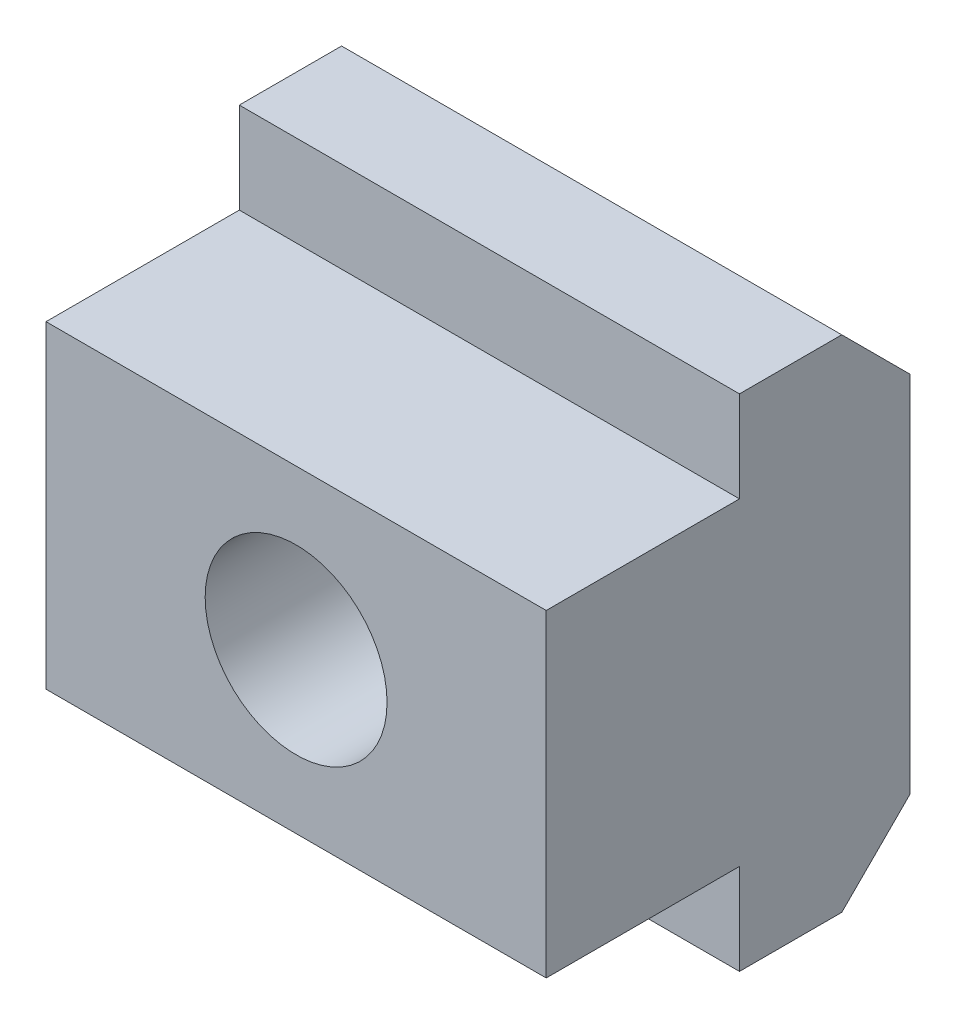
ISO-10303-21;
HEADER;
FILE_DESCRIPTION(('STEP AP214'),'2;1');
FILE_NAME('part.step','',(''),(''),'','','');
FILE_SCHEMA(('AUTOMOTIVE_DESIGN { 1 0 10303 214 1 1 1 1 }'));
ENDSEC;
DATA;
#1=APPLICATION_CONTEXT('core data for automotive mechanical design processes');
#2=APPLICATION_PROTOCOL_DEFINITION('international standard','automotive_design',2000,#1);
#3=PRODUCT_CONTEXT('',#1,'mechanical');
#4=PRODUCT('Part','Part','',(#3));
#5=PRODUCT_RELATED_PRODUCT_CATEGORY('part','',(#4));
#6=PRODUCT_DEFINITION_FORMATION('','',#4);
#7=PRODUCT_DEFINITION_CONTEXT('part definition',#1,'design');
#8=PRODUCT_DEFINITION('design','',#6,#7);
#9=PRODUCT_DEFINITION_SHAPE('','',#8);
#10=(LENGTH_UNIT() NAMED_UNIT(*) SI_UNIT(.MILLI.,.METRE.));
#11=(NAMED_UNIT(*) PLANE_ANGLE_UNIT() SI_UNIT($,.RADIAN.));
#12=(NAMED_UNIT(*) SI_UNIT($,.STERADIAN.) SOLID_ANGLE_UNIT());
#13=UNCERTAINTY_MEASURE_WITH_UNIT(LENGTH_MEASURE(1.E-05),#10,'distance_accuracy_value','');
#14=(GEOMETRIC_REPRESENTATION_CONTEXT(3) GLOBAL_UNCERTAINTY_ASSIGNED_CONTEXT((#13)) GLOBAL_UNIT_ASSIGNED_CONTEXT((#10,
#11,#12)) REPRESENTATION_CONTEXT('',''));
#15=CARTESIAN_POINT('',(0.,0.,0.));
#16=DIRECTION('',(0.,0.,1.));
#17=DIRECTION('',(1.,0.,0.));
#18=AXIS2_PLACEMENT_3D('',#15,#16,#17);
#19=CARTESIAN_POINT('',(11.,7.,8.5));
#20=DIRECTION('',(0.,-1.,0.));
#21=DIRECTION('',(1.,0.,0.));
#22=AXIS2_PLACEMENT_3D('',#19,#20,#21);
#23=PLANE('',#22);
#24=DIRECTION('',(0.,0.,1.));
#25=VECTOR('',#24,1.);
#26=CARTESIAN_POINT('',(-11.,7.,8.5));
#27=LINE('',#26,#25);
#28=CARTESIAN_POINT('',(-11.,7.,0.));
#29=VERTEX_POINT('',#28);
#30=CARTESIAN_POINT('',(-11.,7.,8.5));
#31=VERTEX_POINT('',#30);
#32=EDGE_CURVE('E98',#29,#31,#27,.T.);
#33=ORIENTED_EDGE('',*,*,#32,.T.);
#34=DIRECTION('',(-1.,0.,0.));
#35=VECTOR('',#34,1.);
#36=CARTESIAN_POINT('',(11.,7.,8.5));
#37=LINE('',#36,#35);
#38=CARTESIAN_POINT('',(11.,7.,8.5));
#39=VERTEX_POINT('',#38);
#40=EDGE_CURVE('E106',#39,#31,#37,.T.);
#41=ORIENTED_EDGE('',*,*,#40,.F.);
#42=DIRECTION('',(0.,0.,1.));
#43=VECTOR('',#42,1.);
#44=CARTESIAN_POINT('',(11.,7.,8.5));
#45=LINE('',#44,#43);
#46=CARTESIAN_POINT('',(11.,7.,0.));
#47=VERTEX_POINT('',#46);
#48=EDGE_CURVE('E136',#47,#39,#45,.T.);
#49=ORIENTED_EDGE('',*,*,#48,.F.);
#50=DIRECTION('',(-1.,0.,0.));
#51=VECTOR('',#50,1.);
#52=CARTESIAN_POINT('',(11.,7.,0.));
#53=LINE('',#52,#51);
#54=EDGE_CURVE('E117',#47,#29,#53,.T.);
#55=ORIENTED_EDGE('',*,*,#54,.T.);
#56=EDGE_LOOP('',(#33,#41,#49,#55));
#57=FACE_BOUND('',#56,.T.);
#58=ADVANCED_FACE('F14',(#57),#23,.F.);
#59=CARTESIAN_POINT('',(11.,-7.,8.5));
#60=DIRECTION('',(0.,0.,-1.));
#61=DIRECTION('',(-1.,0.,0.));
#62=AXIS2_PLACEMENT_3D('',#59,#60,#61);
#63=PLANE('',#62);
#64=CARTESIAN_POINT('',(0.,0.,8.5));
#65=DIRECTION('',(0.,0.,1.));
#66=DIRECTION('',(1.,0.,0.));
#67=AXIS2_PLACEMENT_3D('',#64,#65,#66);
#68=CIRCLE('',#67,4.);
#69=CARTESIAN_POINT('',(4.,0.,8.5));
#70=VERTEX_POINT('',#69);
#71=EDGE_CURVE('E121',#70,#70,#68,.T.);
#72=ORIENTED_EDGE('',*,*,#71,.F.);
#73=EDGE_LOOP('',(#72));
#74=FACE_BOUND('',#73,.T.);
#75=DIRECTION('',(0.,-1.,0.));
#76=VECTOR('',#75,1.);
#77=CARTESIAN_POINT('',(-11.,-7.,8.5));
#78=LINE('',#77,#76);
#79=CARTESIAN_POINT('',(-11.,-7.,8.5));
#80=VERTEX_POINT('',#79);
#81=EDGE_CURVE('E92',#31,#80,#78,.T.);
#82=ORIENTED_EDGE('',*,*,#81,.T.);
#83=DIRECTION('',(-1.,0.,0.));
#84=VECTOR('',#83,1.);
#85=CARTESIAN_POINT('',(11.,-7.,8.5));
#86=LINE('',#85,#84);
#87=CARTESIAN_POINT('',(11.,-7.,8.5));
#88=VERTEX_POINT('',#87);
#89=EDGE_CURVE('E113',#88,#80,#86,.T.);
#90=ORIENTED_EDGE('',*,*,#89,.F.);
#91=DIRECTION('',(0.,-1.,0.));
#92=VECTOR('',#91,1.);
#93=CARTESIAN_POINT('',(11.,-7.,8.5));
#94=LINE('',#93,#92);
#95=EDGE_CURVE('E108',#39,#88,#94,.T.);
#96=ORIENTED_EDGE('',*,*,#95,.F.);
#97=ORIENTED_EDGE('',*,*,#40,.T.);
#98=EDGE_LOOP('',(#82,#90,#96,#97));
#99=FACE_BOUND('',#98,.T.);
#100=ADVANCED_FACE('F107',(#74,#99),#63,.F.);
#101=CARTESIAN_POINT('',(11.,-7.,8.5));
#102=DIRECTION('',(0.,1.,0.));
#103=DIRECTION('',(-1.,0.,0.));
#104=AXIS2_PLACEMENT_3D('',#101,#102,#103);
#105=PLANE('',#104);
#106=DIRECTION('',(0.,0.,-1.));
#107=VECTOR('',#106,1.);
#108=CARTESIAN_POINT('',(-11.,-7.,8.5));
#109=LINE('',#108,#107);
#110=CARTESIAN_POINT('',(-11.,-7.,0.));
#111=VERTEX_POINT('',#110);
#112=EDGE_CURVE('E100',#80,#111,#109,.T.);
#113=ORIENTED_EDGE('',*,*,#112,.T.);
#114=DIRECTION('',(-1.,0.,0.));
#115=VECTOR('',#114,1.);
#116=CARTESIAN_POINT('',(11.,-7.,0.));
#117=LINE('',#116,#115);
#118=CARTESIAN_POINT('',(11.,-7.,0.));
#119=VERTEX_POINT('',#118);
#120=EDGE_CURVE('E158',#119,#111,#117,.T.);
#121=ORIENTED_EDGE('',*,*,#120,.F.);
#122=DIRECTION('',(0.,0.,-1.));
#123=VECTOR('',#122,1.);
#124=CARTESIAN_POINT('',(11.,-7.,8.5));
#125=LINE('',#124,#123);
#126=EDGE_CURVE('E139',#88,#119,#125,.T.);
#127=ORIENTED_EDGE('',*,*,#126,.F.);
#128=ORIENTED_EDGE('',*,*,#89,.T.);
#129=EDGE_LOOP('',(#113,#121,#127,#128));
#130=FACE_BOUND('',#129,.T.);
#131=ADVANCED_FACE('F199',(#130),#105,.F.);
#132=CARTESIAN_POINT('',(11.,-7.,0.));
#133=DIRECTION('',(0.,0.,-1.));
#134=DIRECTION('',(0.,1.,0.));
#135=AXIS2_PLACEMENT_3D('',#132,#133,#134);
#136=PLANE('',#135);
#137=DIRECTION('',(0.,-1.,0.));
#138=VECTOR('',#137,1.);
#139=CARTESIAN_POINT('',(-11.,-7.,0.));
#140=LINE('',#139,#138);
#141=CARTESIAN_POINT('',(-11.,-11.,0.));
#142=VERTEX_POINT('',#141);
#143=EDGE_CURVE('E126',#111,#142,#140,.T.);
#144=ORIENTED_EDGE('',*,*,#143,.T.);
#145=DIRECTION('',(-1.,0.,0.));
#146=VECTOR('',#145,1.);
#147=CARTESIAN_POINT('',(11.,-11.,0.));
#148=LINE('',#147,#146);
#149=CARTESIAN_POINT('',(11.,-11.,0.));
#150=VERTEX_POINT('',#149);
#151=EDGE_CURVE('E155',#150,#142,#148,.T.);
#152=ORIENTED_EDGE('',*,*,#151,.F.);
#153=DIRECTION('',(0.,-1.,0.));
#154=VECTOR('',#153,1.);
#155=CARTESIAN_POINT('',(11.,-7.,0.));
#156=LINE('',#155,#154);
#157=EDGE_CURVE('E141',#119,#150,#156,.T.);
#158=ORIENTED_EDGE('',*,*,#157,.F.);
#159=ORIENTED_EDGE('',*,*,#120,.T.);
#160=EDGE_LOOP('',(#144,#152,#158,#159));
#161=FACE_BOUND('',#160,.T.);
#162=ADVANCED_FACE('F195',(#161),#136,.F.);
#163=CARTESIAN_POINT('',(11.,-11.,0.));
#164=DIRECTION('',(0.,1.,0.));
#165=DIRECTION('',(-1.,0.,0.));
#166=AXIS2_PLACEMENT_3D('',#163,#164,#165);
#167=PLANE('',#166);
#168=DIRECTION('',(0.,0.,-1.));
#169=VECTOR('',#168,1.);
#170=CARTESIAN_POINT('',(-11.,-11.,0.));
#171=LINE('',#170,#169);
#172=CARTESIAN_POINT('',(-11.,-11.,-4.5));
#173=VERTEX_POINT('',#172);
#174=EDGE_CURVE('E128',#142,#173,#171,.T.);
#175=ORIENTED_EDGE('',*,*,#174,.T.);
#176=DIRECTION('',(1.,0.,0.));
#177=VECTOR('',#176,1.);
#178=CARTESIAN_POINT('',(11.,-11.,-4.5));
#179=LINE('',#178,#177);
#180=CARTESIAN_POINT('',(11.,-11.,-4.5));
#181=VERTEX_POINT('',#180);
#182=EDGE_CURVE('E9',#173,#181,#179,.T.);
#183=ORIENTED_EDGE('',*,*,#182,.T.);
#184=DIRECTION('',(0.,0.,-1.));
#185=VECTOR('',#184,1.);
#186=CARTESIAN_POINT('',(11.,-11.,0.));
#187=LINE('',#186,#185);
#188=EDGE_CURVE('E143',#150,#181,#187,.T.);
#189=ORIENTED_EDGE('',*,*,#188,.F.);
#190=ORIENTED_EDGE('',*,*,#151,.T.);
#191=EDGE_LOOP('',(#175,#183,#189,#190));
#192=FACE_BOUND('',#191,.T.);
#193=ADVANCED_FACE('F191',(#192),#167,.F.);
#194=CARTESIAN_POINT('',(11.,-11.,-7.5));
#195=DIRECTION('',(0.,0.,1.));
#196=DIRECTION('',(1.,0.,0.));
#197=AXIS2_PLACEMENT_3D('',#194,#195,#196);
#198=PLANE('',#197);
#199=CARTESIAN_POINT('',(0.,0.,-7.5));
#200=DIRECTION('',(0.,0.,1.));
#201=DIRECTION('',(1.,0.,0.));
#202=AXIS2_PLACEMENT_3D('',#199,#200,#201);
#203=CIRCLE('',#202,4.);
#204=CARTESIAN_POINT('',(4.,0.,-7.5));
#205=VERTEX_POINT('',#204);
#206=EDGE_CURVE('E118',#205,#205,#203,.T.);
#207=ORIENTED_EDGE('',*,*,#206,.T.);
#208=EDGE_LOOP('',(#207));
#209=FACE_BOUND('',#208,.T.);
#210=DIRECTION('',(0.,1.,0.));
#211=VECTOR('',#210,1.);
#212=CARTESIAN_POINT('',(-11.,-11.,-7.5));
#213=LINE('',#212,#211);
#214=CARTESIAN_POINT('',(-11.,-8.,-7.5));
#215=VERTEX_POINT('',#214);
#216=CARTESIAN_POINT('',(-11.,8.,-7.5));
#217=VERTEX_POINT('',#216);
#218=EDGE_CURVE('E130',#215,#217,#213,.T.);
#219=ORIENTED_EDGE('',*,*,#218,.T.);
#220=DIRECTION('',(1.,0.,0.));
#221=VECTOR('',#220,1.);
#222=CARTESIAN_POINT('',(11.,8.,-7.5));
#223=LINE('',#222,#221);
#224=CARTESIAN_POINT('',(11.,8.,-7.5));
#225=VERTEX_POINT('',#224);
#226=EDGE_CURVE('E34',#217,#225,#223,.T.);
#227=ORIENTED_EDGE('',*,*,#226,.T.);
#228=DIRECTION('',(0.,1.,0.));
#229=VECTOR('',#228,1.);
#230=CARTESIAN_POINT('',(11.,-11.,-7.5));
#231=LINE('',#230,#229);
#232=CARTESIAN_POINT('',(11.,-8.,-7.5));
#233=VERTEX_POINT('',#232);
#234=EDGE_CURVE('E145',#233,#225,#231,.T.);
#235=ORIENTED_EDGE('',*,*,#234,.F.);
#236=DIRECTION('',(-1.,0.,0.));
#237=VECTOR('',#236,1.);
#238=CARTESIAN_POINT('',(11.,-8.,-7.5));
#239=LINE('',#238,#237);
#240=EDGE_CURVE('E168',#233,#215,#239,.T.);
#241=ORIENTED_EDGE('',*,*,#240,.T.);
#242=EDGE_LOOP('',(#219,#227,#235,#241));
#243=FACE_BOUND('',#242,.T.);
#244=ADVANCED_FACE('F185',(#209,#243),#198,.F.);
#245=CARTESIAN_POINT('',(11.,11.,0.));
#246=DIRECTION('',(0.,-1.,0.));
#247=DIRECTION('',(1.,0.,0.));
#248=AXIS2_PLACEMENT_3D('',#245,#246,#247);
#249=PLANE('',#248);
#250=DIRECTION('',(0.,0.,1.));
#251=VECTOR('',#250,1.);
#252=CARTESIAN_POINT('',(11.,11.,0.));
#253=LINE('',#252,#251);
#254=CARTESIAN_POINT('',(11.,11.,-4.5));
#255=VERTEX_POINT('',#254);
#256=CARTESIAN_POINT('',(11.,11.,0.));
#257=VERTEX_POINT('',#256);
#258=EDGE_CURVE('E147',#255,#257,#253,.T.);
#259=ORIENTED_EDGE('',*,*,#258,.F.);
#260=DIRECTION('',(-1.,0.,0.));
#261=VECTOR('',#260,1.);
#262=CARTESIAN_POINT('',(11.,11.,-4.5));
#263=LINE('',#262,#261);
#264=CARTESIAN_POINT('',(-11.,11.,-4.5));
#265=VERTEX_POINT('',#264);
#266=EDGE_CURVE('E112',#255,#265,#263,.T.);
#267=ORIENTED_EDGE('',*,*,#266,.T.);
#268=DIRECTION('',(0.,0.,1.));
#269=VECTOR('',#268,1.);
#270=CARTESIAN_POINT('',(-11.,11.,0.));
#271=LINE('',#270,#269);
#272=CARTESIAN_POINT('',(-11.,11.,0.));
#273=VERTEX_POINT('',#272);
#274=EDGE_CURVE('E132',#265,#273,#271,.T.);
#275=ORIENTED_EDGE('',*,*,#274,.T.);
#276=DIRECTION('',(-1.,0.,0.));
#277=VECTOR('',#276,1.);
#278=CARTESIAN_POINT('',(11.,11.,0.));
#279=LINE('',#278,#277);
#280=EDGE_CURVE('E152',#257,#273,#279,.T.);
#281=ORIENTED_EDGE('',*,*,#280,.F.);
#282=EDGE_LOOP('',(#259,#267,#275,#281));
#283=FACE_BOUND('',#282,.T.);
#284=ADVANCED_FACE('F181',(#283),#249,.F.);
#285=CARTESIAN_POINT('',(11.,7.,0.));
#286=DIRECTION('',(0.,0.,-1.));
#287=DIRECTION('',(0.,1.,0.));
#288=AXIS2_PLACEMENT_3D('',#285,#286,#287);
#289=PLANE('',#288);
#290=DIRECTION('',(0.,-1.,0.));
#291=VECTOR('',#290,1.);
#292=CARTESIAN_POINT('',(-11.,7.,0.));
#293=LINE('',#292,#291);
#294=EDGE_CURVE('E134',#273,#29,#293,.T.);
#295=ORIENTED_EDGE('',*,*,#294,.T.);
#296=ORIENTED_EDGE('',*,*,#54,.F.);
#297=DIRECTION('',(0.,-1.,0.));
#298=VECTOR('',#297,1.);
#299=CARTESIAN_POINT('',(11.,7.,0.));
#300=LINE('',#299,#298);
#301=EDGE_CURVE('E149',#257,#47,#300,.T.);
#302=ORIENTED_EDGE('',*,*,#301,.F.);
#303=ORIENTED_EDGE('',*,*,#280,.T.);
#304=EDGE_LOOP('',(#295,#296,#302,#303));
#305=FACE_BOUND('',#304,.T.);
#306=ADVANCED_FACE('F201',(#305),#289,.F.);
#307=CARTESIAN_POINT('',(11.,7.,-7.5));
#308=DIRECTION('',(1.,0.,0.));
#309=DIRECTION('',(0.,1.,0.));
#310=AXIS2_PLACEMENT_3D('',#307,#308,#309);
#311=PLANE('',#310);
#312=ORIENTED_EDGE('',*,*,#234,.T.);
#313=DIRECTION('',(0.,-0.707106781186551,-0.707106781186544));
#314=VECTOR('',#313,1.);
#315=CARTESIAN_POINT('',(11.,7.5,-8.));
#316=LINE('',#315,#314);
#317=EDGE_CURVE('E21',#225,#255,#316,.F.);
#318=ORIENTED_EDGE('',*,*,#317,.T.);
#319=ORIENTED_EDGE('',*,*,#258,.T.);
#320=ORIENTED_EDGE('',*,*,#301,.T.);
#321=ORIENTED_EDGE('',*,*,#48,.T.);
#322=ORIENTED_EDGE('',*,*,#95,.T.);
#323=ORIENTED_EDGE('',*,*,#126,.T.);
#324=ORIENTED_EDGE('',*,*,#157,.T.);
#325=ORIENTED_EDGE('',*,*,#188,.T.);
#326=DIRECTION('',(0.,-0.707106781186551,0.707106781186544));
#327=VECTOR('',#326,1.);
#328=CARTESIAN_POINT('',(11.,-0.499999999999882,-15.));
#329=LINE('',#328,#327);
#330=EDGE_CURVE('E172',#181,#233,#329,.F.);
#331=ORIENTED_EDGE('',*,*,#330,.T.);
#332=EDGE_LOOP('',(#312,#318,#319,#320,#321,#322,#323,#324,#325,#331));
#333=FACE_BOUND('',#332,.T.);
#334=ADVANCED_FACE('F176',(#333),#311,.T.);
#335=CARTESIAN_POINT('',(-11.,7.,-7.5));
#336=DIRECTION('',(1.,0.,0.));
#337=DIRECTION('',(0.,1.,0.));
#338=AXIS2_PLACEMENT_3D('',#335,#336,#337);
#339=PLANE('',#338);
#340=ORIENTED_EDGE('',*,*,#274,.F.);
#341=DIRECTION('',(0.,0.707106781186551,0.707106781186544));
#342=VECTOR('',#341,1.);
#343=CARTESIAN_POINT('',(-11.,11.,-4.5));
#344=LINE('',#343,#342);
#345=EDGE_CURVE('E166',#265,#217,#344,.F.);
#346=ORIENTED_EDGE('',*,*,#345,.T.);
#347=ORIENTED_EDGE('',*,*,#218,.F.);
#348=DIRECTION('',(0.,0.707106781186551,-0.707106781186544));
#349=VECTOR('',#348,1.);
#350=CARTESIAN_POINT('',(-11.,-8.,-7.5));
#351=LINE('',#350,#349);
#352=EDGE_CURVE('E164',#215,#173,#351,.F.);
#353=ORIENTED_EDGE('',*,*,#352,.T.);
#354=ORIENTED_EDGE('',*,*,#174,.F.);
#355=ORIENTED_EDGE('',*,*,#143,.F.);
#356=ORIENTED_EDGE('',*,*,#112,.F.);
#357=ORIENTED_EDGE('',*,*,#81,.F.);
#358=ORIENTED_EDGE('',*,*,#32,.F.);
#359=ORIENTED_EDGE('',*,*,#294,.F.);
#360=EDGE_LOOP('',(#340,#346,#347,#353,#354,#355,#356,#357,#358,#359));
#361=FACE_BOUND('',#360,.T.);
#362=ADVANCED_FACE('F95',(#361),#339,.F.);
#363=CARTESIAN_POINT('',(11.,11.,-4.5));
#364=DIRECTION('',(0.,-0.707106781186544,0.707106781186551));
#365=DIRECTION('',(0.,-0.707106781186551,-0.707106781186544));
#366=AXIS2_PLACEMENT_3D('',#363,#364,#365);
#367=PLANE('',#366);
#368=ORIENTED_EDGE('',*,*,#317,.F.);
#369=ORIENTED_EDGE('',*,*,#226,.F.);
#370=ORIENTED_EDGE('',*,*,#345,.F.);
#371=ORIENTED_EDGE('',*,*,#266,.F.);
#372=EDGE_LOOP('',(#368,#369,#370,#371));
#373=FACE_BOUND('',#372,.T.);
#374=ADVANCED_FACE('F183',(#373),#367,.F.);
#375=CARTESIAN_POINT('',(11.,-8.,-7.5));
#376=DIRECTION('',(0.,0.707106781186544,0.707106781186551));
#377=DIRECTION('',(0.,-0.707106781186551,0.707106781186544));
#378=AXIS2_PLACEMENT_3D('',#375,#376,#377);
#379=PLANE('',#378);
#380=ORIENTED_EDGE('',*,*,#330,.F.);
#381=ORIENTED_EDGE('',*,*,#182,.F.);
#382=ORIENTED_EDGE('',*,*,#352,.F.);
#383=ORIENTED_EDGE('',*,*,#240,.F.);
#384=EDGE_LOOP('',(#380,#381,#382,#383));
#385=FACE_BOUND('',#384,.T.);
#386=ADVANCED_FACE('F189',(#385),#379,.F.);
#387=CARTESIAN_POINT('',(0.,0.,-7.5));
#388=DIRECTION('',(0.,0.,1.));
#389=DIRECTION('',(1.,0.,0.));
#390=AXIS2_PLACEMENT_3D('',#387,#388,#389);
#391=CYLINDRICAL_SURFACE('',#390,4.);
#392=ORIENTED_EDGE('',*,*,#206,.F.);
#393=EDGE_LOOP('',(#392));
#394=FACE_BOUND('',#393,.T.);
#395=ORIENTED_EDGE('',*,*,#71,.T.);
#396=EDGE_LOOP('',(#395));
#397=FACE_BOUND('',#396,.T.);
#398=ADVANCED_FACE('F236',(#394,#397),#391,.F.);
#399=CLOSED_SHELL('',(#58,#100,#131,#162,#193,#244,#284,#306,#334,#362,#374,#386,#398));
#400=MANIFOLD_SOLID_BREP('B1',#399);
#401=ADVANCED_BREP_SHAPE_REPRESENTATION('',(#18,#400),#14);
#402=SHAPE_DEFINITION_REPRESENTATION(#9,#401);
ENDSEC;
END-ISO-10303-21;
